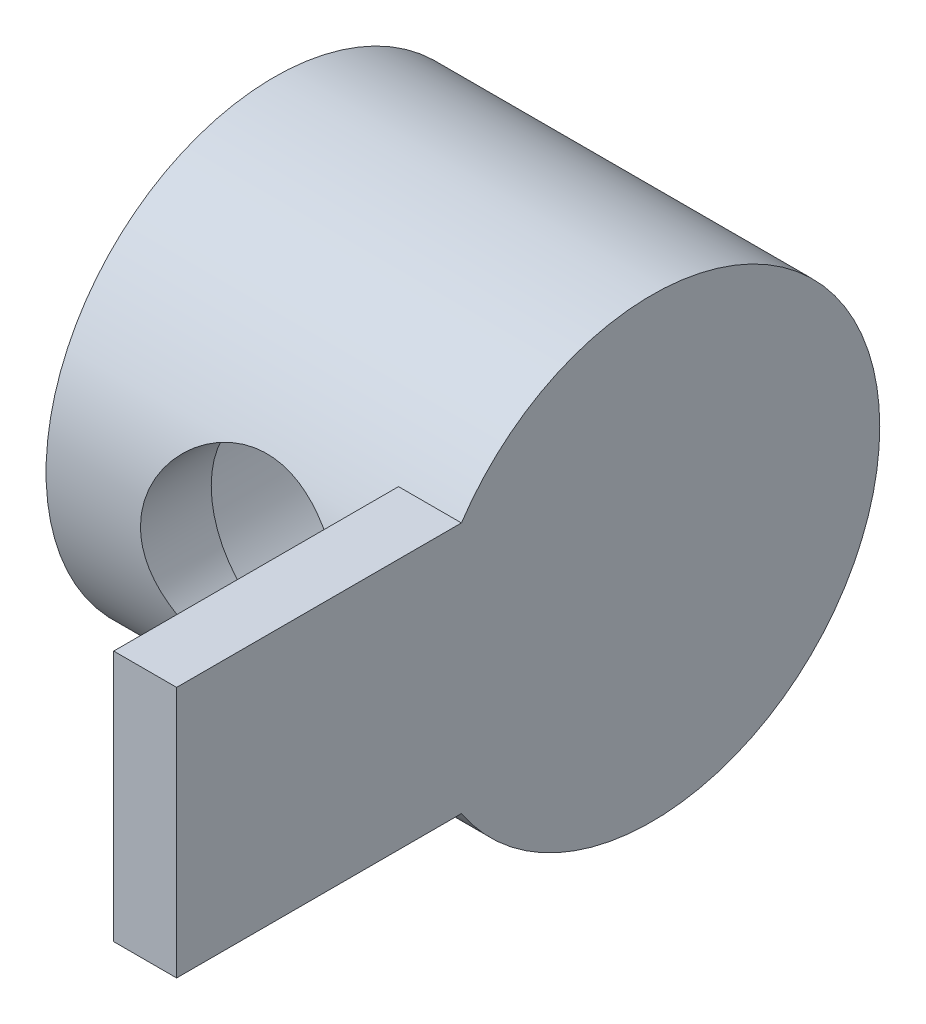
ISO-10303-21;
HEADER;
FILE_DESCRIPTION(('STEP AP214'),'2;1');
FILE_NAME('part.step','',(''),(''),'','','');
FILE_SCHEMA(('AUTOMOTIVE_DESIGN { 1 0 10303 214 1 1 1 1 }'));
ENDSEC;
DATA;
#1=APPLICATION_CONTEXT('core data for automotive mechanical design processes');
#2=APPLICATION_PROTOCOL_DEFINITION('international standard','automotive_design',2000,#1);
#3=PRODUCT_CONTEXT('',#1,'mechanical');
#4=PRODUCT('Part','Part','',(#3));
#5=PRODUCT_RELATED_PRODUCT_CATEGORY('part','',(#4));
#6=PRODUCT_DEFINITION_FORMATION('','',#4);
#7=PRODUCT_DEFINITION_CONTEXT('part definition',#1,'design');
#8=PRODUCT_DEFINITION('design','',#6,#7);
#9=PRODUCT_DEFINITION_SHAPE('','',#8);
#10=(LENGTH_UNIT() NAMED_UNIT(*) SI_UNIT(.MILLI.,.METRE.));
#11=(NAMED_UNIT(*) PLANE_ANGLE_UNIT() SI_UNIT($,.RADIAN.));
#12=(NAMED_UNIT(*) SI_UNIT($,.STERADIAN.) SOLID_ANGLE_UNIT());
#13=UNCERTAINTY_MEASURE_WITH_UNIT(LENGTH_MEASURE(1.E-05),#10,'distance_accuracy_value','');
#14=(GEOMETRIC_REPRESENTATION_CONTEXT(3) GLOBAL_UNCERTAINTY_ASSIGNED_CONTEXT((#13)) GLOBAL_UNIT_ASSIGNED_CONTEXT((#10,
#11,#12)) REPRESENTATION_CONTEXT('',''));
#15=CARTESIAN_POINT('',(0.,0.,0.));
#16=DIRECTION('',(0.,0.,1.));
#17=DIRECTION('',(1.,0.,0.));
#18=AXIS2_PLACEMENT_3D('',#15,#16,#17);
#19=CARTESIAN_POINT('',(3.483226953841,0.,5.));
#20=DIRECTION('',(0.,0.,-1.));
#21=DIRECTION('',(-1.,0.,0.));
#22=AXIS2_PLACEMENT_3D('',#19,#20,#21);
#23=PLANE('',#22);
#24=CARTESIAN_POINT('',(10.25,0.,5.));
#25=DIRECTION('',(0.,0.,1.));
#26=DIRECTION('',(1.,0.,0.));
#27=AXIS2_PLACEMENT_3D('',#24,#25,#26);
#28=CIRCLE('',#27,5.);
#29=CARTESIAN_POINT('',(15.25,0.,5.));
#30=VERTEX_POINT('',#29);
#31=EDGE_CURVE('E103',#30,#30,#28,.F.);
#32=ORIENTED_EDGE('',*,*,#31,.T.);
#33=EDGE_LOOP('',(#32));
#34=FACE_BOUND('',#33,.T.);
#35=CARTESIAN_POINT('',(10.25,0.,5.));
#36=DIRECTION('',(0.,0.,-1.));
#37=DIRECTION('',(-1.,0.,0.));
#38=AXIS2_PLACEMENT_3D('',#35,#36,#37);
#39=CIRCLE('',#38,3.25);
#40=CARTESIAN_POINT('',(7.,0.,5.));
#41=VERTEX_POINT('',#40);
#42=EDGE_CURVE('E19',#41,#41,#39,.F.);
#43=ORIENTED_EDGE('',*,*,#42,.T.);
#44=EDGE_LOOP('',(#43));
#45=FACE_BOUND('',#44,.T.);
#46=ADVANCED_FACE('F16',(#34,#45),#23,.T.);
#47=CARTESIAN_POINT('',(4.,9.88,0.));
#48=DIRECTION('',(1.,0.,0.));
#49=DIRECTION('',(0.,0.,-1.));
#50=AXIS2_PLACEMENT_3D('',#47,#48,#49);
#51=PLANE('',#50);
#52=CARTESIAN_POINT('',(4.,0.,0.));
#53=DIRECTION('',(1.,0.,0.));
#54=DIRECTION('',(0.,0.,-1.));
#55=AXIS2_PLACEMENT_3D('',#52,#53,#54);
#56=CIRCLE('',#55,7.25);
#57=CARTESIAN_POINT('',(4.,0.,-7.25));
#58=VERTEX_POINT('',#57);
#59=EDGE_CURVE('E95',#58,#58,#56,.T.);
#60=ORIENTED_EDGE('',*,*,#59,.F.);
#61=EDGE_LOOP('',(#60));
#62=FACE_BOUND('',#61,.T.);
#63=ADVANCED_FACE('F147',(#62),#51,.F.);
#64=CARTESIAN_POINT('',(10.25,0.,7.25));
#65=DIRECTION('',(0.,0.,-1.));
#66=DIRECTION('',(-1.,0.,0.));
#67=AXIS2_PLACEMENT_3D('',#64,#65,#66);
#68=CYLINDRICAL_SURFACE('',#67,3.25);
#69=CARTESIAN_POINT('',(7.,0.,7.25));
#70=CARTESIAN_POINT('',(7.00001207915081,0.1730771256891,7.24999031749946));
#71=CARTESIAN_POINT('',(7.01389619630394,0.346290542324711,7.24373775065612));
#72=CARTESIAN_POINT('',(7.06885485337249,0.687593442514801,7.21935611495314));
#73=CARTESIAN_POINT('',(7.10996312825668,0.855676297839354,7.20121231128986));
#74=CARTESIAN_POINT('',(7.21750337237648,1.18143697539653,7.15497693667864));
#75=CARTESIAN_POINT('',(7.28385529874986,1.33914585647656,7.12691682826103));
#76=CARTESIAN_POINT('',(7.43961090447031,1.64106509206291,7.06351455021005));
#77=CARTESIAN_POINT('',(7.52901591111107,1.78527466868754,7.02817196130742));
#78=CARTESIAN_POINT('',(7.73360767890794,2.06439590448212,6.95145927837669));
#79=CARTESIAN_POINT('',(7.8498827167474,2.19844967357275,6.90987284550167));
#80=CARTESIAN_POINT('',(8.10259558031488,2.44590672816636,6.82620933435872));
#81=CARTESIAN_POINT('',(8.23904434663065,2.55929873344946,6.78413200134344));
#82=CARTESIAN_POINT('',(8.53796140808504,2.76887368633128,6.70143888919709));
#83=CARTESIAN_POINT('',(8.70149000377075,2.86364619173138,6.6610558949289));
#84=CARTESIAN_POINT('',(9.04422170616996,3.02395910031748,6.58983478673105));
#85=CARTESIAN_POINT('',(9.22341558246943,3.08951658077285,6.55899109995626));
#86=CARTESIAN_POINT('',(9.58251657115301,3.18585105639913,6.51272514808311));
#87=CARTESIAN_POINT('',(9.76187860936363,3.21829278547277,6.49656977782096));
#88=CARTESIAN_POINT('',(10.1241711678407,3.25264726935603,6.47944404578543));
#89=CARTESIAN_POINT('',(10.3070991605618,3.25458091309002,6.47846329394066));
#90=CARTESIAN_POINT('',(10.6534406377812,3.22910403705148,6.49118752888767));
#91=CARTESIAN_POINT('',(10.8171097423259,3.20435907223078,6.50355860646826));
#92=CARTESIAN_POINT('',(11.1376652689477,3.13075179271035,6.53930803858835));
#93=CARTESIAN_POINT('',(11.2945501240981,3.08188393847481,6.56268892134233));
#94=CARTESIAN_POINT('',(11.6013281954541,2.96044850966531,6.61836639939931));
#95=CARTESIAN_POINT('',(11.7509833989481,2.88737047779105,6.65085247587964));
#96=CARTESIAN_POINT('',(12.0365408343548,2.71996261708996,6.72105148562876));
#97=CARTESIAN_POINT('',(12.1724376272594,2.62562443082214,6.75876647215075));
#98=CARTESIAN_POINT('',(12.4408179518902,2.40740567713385,6.8397158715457));
#99=CARTESIAN_POINT('',(12.5716264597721,2.28152316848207,6.88312672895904));
#100=CARTESIAN_POINT('',(12.8109131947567,2.00925841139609,6.96747591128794));
#101=CARTESIAN_POINT('',(12.9193790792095,1.86286490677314,7.0084128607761));
#102=CARTESIAN_POINT('',(13.1139663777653,1.54772362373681,7.08477352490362));
#103=CARTESIAN_POINT('',(13.1992882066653,1.37842232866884,7.11998624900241));
#104=CARTESIAN_POINT('',(13.3044569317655,1.11435995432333,7.16440691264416));
#105=CARTESIAN_POINT('',(13.3357040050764,1.02468668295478,7.17781089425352));
#106=CARTESIAN_POINT('',(13.390315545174,0.842578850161,7.20145610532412));
#107=CARTESIAN_POINT('',(13.4136832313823,0.750145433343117,7.21169862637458));
#108=CARTESIAN_POINT('',(13.4551715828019,0.549045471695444,7.22998767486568));
#109=CARTESIAN_POINT('',(13.4719547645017,0.440047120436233,7.23746374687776));
#110=CARTESIAN_POINT('',(13.4943726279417,0.220717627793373,7.24747290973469));
#111=CARTESIAN_POINT('',(13.5000077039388,0.11038653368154,7.25000617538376));
#112=CARTESIAN_POINT('',(13.4999879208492,-0.173077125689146,7.24999031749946));
#113=CARTESIAN_POINT('',(13.4861038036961,-0.346290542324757,7.24373775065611));
#114=CARTESIAN_POINT('',(13.4311451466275,-0.687593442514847,7.21935611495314));
#115=CARTESIAN_POINT('',(13.3900368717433,-0.855676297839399,7.20121231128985));
#116=CARTESIAN_POINT('',(13.2824966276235,-1.18143697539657,7.15497693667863));
#117=CARTESIAN_POINT('',(13.2161447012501,-1.3391458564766,7.12691682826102));
#118=CARTESIAN_POINT('',(13.0603890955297,-1.64106509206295,7.06351455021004));
#119=CARTESIAN_POINT('',(12.9709840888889,-1.78527466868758,7.02817196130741));
#120=CARTESIAN_POINT('',(12.766392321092,-2.06439590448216,6.95145927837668));
#121=CARTESIAN_POINT('',(12.6501172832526,-2.19844967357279,6.90987284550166));
#122=CARTESIAN_POINT('',(12.3974044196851,-2.4459067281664,6.82620933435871));
#123=CARTESIAN_POINT('',(12.2609556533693,-2.55929873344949,6.78413200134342));
#124=CARTESIAN_POINT('',(11.9620385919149,-2.76887368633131,6.70143888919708));
#125=CARTESIAN_POINT('',(11.7985099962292,-2.86364619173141,6.66105589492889));
#126=CARTESIAN_POINT('',(11.45577829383,-3.0239591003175,6.58983478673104));
#127=CARTESIAN_POINT('',(11.2765844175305,-3.08951658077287,6.55899109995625));
#128=CARTESIAN_POINT('',(10.9174834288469,-3.18585105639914,6.5127251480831));
#129=CARTESIAN_POINT('',(10.7381213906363,-3.21829278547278,6.49656977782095));
#130=CARTESIAN_POINT('',(10.3758288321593,-3.25264726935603,6.47944404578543));
#131=CARTESIAN_POINT('',(10.1929008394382,-3.25458091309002,6.47846329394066));
#132=CARTESIAN_POINT('',(9.84655936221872,-3.22910403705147,6.49118752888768));
#133=CARTESIAN_POINT('',(9.68289025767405,-3.20435907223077,6.50355860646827));
#134=CARTESIAN_POINT('',(9.36233473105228,-3.13075179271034,6.53930803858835));
#135=CARTESIAN_POINT('',(9.20544987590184,-3.08188393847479,6.56268892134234));
#136=CARTESIAN_POINT('',(8.89867180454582,-2.96044850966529,6.61836639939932));
#137=CARTESIAN_POINT('',(8.74901660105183,-2.88737047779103,6.65085247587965));
#138=CARTESIAN_POINT('',(8.46345916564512,-2.71996261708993,6.72105148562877));
#139=CARTESIAN_POINT('',(8.32756237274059,-2.6256244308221,6.75876647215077));
#140=CARTESIAN_POINT('',(8.05918204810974,-2.40740567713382,6.83971587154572));
#141=CARTESIAN_POINT('',(7.9283735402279,-2.28152316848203,6.88312672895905));
#142=CARTESIAN_POINT('',(7.68908680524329,-2.00925841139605,6.96747591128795));
#143=CARTESIAN_POINT('',(7.58062092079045,-1.86286490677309,7.00841286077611));
#144=CARTESIAN_POINT('',(7.3860336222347,-1.54772362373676,7.08477352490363));
#145=CARTESIAN_POINT('',(7.30071179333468,-1.37842232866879,7.11998624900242));
#146=CARTESIAN_POINT('',(7.19554306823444,-1.11435995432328,7.16440691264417));
#147=CARTESIAN_POINT('',(7.16429599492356,-1.02468668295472,7.17781089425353));
#148=CARTESIAN_POINT('',(7.10968445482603,-0.842578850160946,7.20145610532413));
#149=CARTESIAN_POINT('',(7.08631676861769,-0.750145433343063,7.21169862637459));
#150=CARTESIAN_POINT('',(7.04482841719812,-0.549045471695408,7.22998767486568));
#151=CARTESIAN_POINT('',(7.02804523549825,-0.440047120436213,7.23746374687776));
#152=CARTESIAN_POINT('',(7.00562737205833,-0.220717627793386,7.24747290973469));
#153=CARTESIAN_POINT('',(6.99999229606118,-0.110386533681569,7.25000617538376));
#154=CARTESIAN_POINT('',(7.,0.,7.25));
#155=B_SPLINE_CURVE_WITH_KNOTS('',3,(#69,#70,#71,#72,#73,#74,#75,#76,#77,#78,#79,#80,#81,#82,
#83,#84,#85,#86,#87,#88,#89,#90,#91,#92,#93,#94,#95,#96,#97,#98,#99,#100,#101,#102,#103,#104,
#105,#106,#107,#108,#109,#110,#111,#112,#113,#114,#115,#116,#117,#118,#119,#120,#121,#122,#123,
#124,#125,#126,#127,#128,#129,#130,#131,#132,#133,#134,#135,#136,#137,#138,#139,#140,#141,#142,
#143,#144,#145,#146,#147,#148,#149,#150,#151,#152,#153,#154),.UNSPECIFIED.,.T.,.F.,(4,2,2,2,2,2,
2,2,2,2,2,2,2,2,2,2,2,2,2,2,2,2,2,2,2,2,2,2,2,2,2,2,2,2,2,2,2,2,2,2,2,2,4),(0.,
0.518816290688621,1.03827668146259,1.55610350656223,2.07396015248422,2.61841275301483,
3.16316171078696,3.74005780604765,4.31661624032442,4.86250268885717,5.40801535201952,
5.90367470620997,6.39944793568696,6.9064211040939,7.4135939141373,7.97106352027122,
8.52884026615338,9.10395932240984,9.39132116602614,9.67856545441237,10.0094720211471,
10.340366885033,10.8591831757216,11.3786435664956,11.8964703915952,12.4143270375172,
12.9587796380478,13.5035285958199,14.0804246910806,14.6569831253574,15.2028695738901,
15.7483822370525,16.2440415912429,16.7398148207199,17.2467879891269,17.7539607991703,
18.3114304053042,18.8692071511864,19.4443262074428,19.7316880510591,20.0189323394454,
20.34983890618,20.6807337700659),.UNSPECIFIED.);
#156=CARTESIAN_POINT('',(7.,0.,7.25));
#157=VERTEX_POINT('',#156);
#158=EDGE_CURVE('E137',#157,#157,#155,.T.);
#159=ORIENTED_EDGE('',*,*,#158,.F.);
#160=EDGE_LOOP('',(#159));
#161=FACE_BOUND('',#160,.T.);
#162=ORIENTED_EDGE('',*,*,#42,.F.);
#163=EDGE_LOOP('',(#162));
#164=FACE_BOUND('',#163,.T.);
#165=ADVANCED_FACE('F144',(#161,#164),#68,.F.);
#166=CARTESIAN_POINT('',(10.25,0.,-2.25));
#167=DIRECTION('',(0.,0.,1.));
#168=DIRECTION('',(1.,0.,0.));
#169=AXIS2_PLACEMENT_3D('',#166,#167,#168);
#170=CYLINDRICAL_SURFACE('',#169,5.);
#171=CARTESIAN_POINT('',(15.25,0.,-7.25));
#172=CARTESIAN_POINT('',(15.2499995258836,0.124583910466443,-7.24999954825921));
#173=CARTESIAN_POINT('',(15.2453368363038,0.249175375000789,-7.24678163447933));
#174=CARTESIAN_POINT('',(15.2267565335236,0.497385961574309,-7.23398651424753));
#175=CARTESIAN_POINT('',(15.2128347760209,0.62100462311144,-7.22440646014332));
#176=CARTESIAN_POINT('',(15.1759249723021,0.866419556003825,-7.19910106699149));
#177=CARTESIAN_POINT('',(15.1529240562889,0.988212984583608,-7.18336700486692));
#178=CARTESIAN_POINT('',(15.0981850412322,1.22896345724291,-7.14611758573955));
#179=CARTESIAN_POINT('',(15.0664431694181,1.34791925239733,-7.12459973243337));
#180=CARTESIAN_POINT('',(14.9948626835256,1.58148869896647,-7.07640620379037));
#181=CARTESIAN_POINT('',(14.955073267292,1.69612393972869,-7.04976191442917));
#182=CARTESIAN_POINT('',(14.8677471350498,1.92119824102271,-6.99178288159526));
#183=CARTESIAN_POINT('',(14.8202073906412,2.03163564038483,-6.96044630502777));
#184=CARTESIAN_POINT('',(14.6667444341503,2.3557188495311,-6.86032646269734));
#185=CARTESIAN_POINT('',(14.5498930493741,2.56240668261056,-6.78537502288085));
#186=CARTESIAN_POINT('',(14.2795179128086,2.97125007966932,-6.61719953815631));
#187=CARTESIAN_POINT('',(14.1236808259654,3.17142875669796,-6.52295075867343));
#188=CARTESIAN_POINT('',(13.7853151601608,3.54472926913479,-6.32785549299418));
#189=CARTESIAN_POINT('',(13.6027458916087,3.71780901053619,-6.22699908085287));
#190=CARTESIAN_POINT('',(13.2942641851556,3.96913479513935,-6.06799533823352));
#191=CARTESIAN_POINT('',(13.1762244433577,4.0569578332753,-6.00946880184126));
#192=CARTESIAN_POINT('',(12.9321753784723,4.22228436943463,-5.8944863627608));
#193=CARTESIAN_POINT('',(12.8061640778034,4.29978529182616,-5.83803097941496));
#194=CARTESIAN_POINT('',(12.4168970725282,4.51579754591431,-5.6747195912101));
#195=CARTESIAN_POINT('',(12.1417891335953,4.63832612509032,-5.57358080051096));
#196=CARTESIAN_POINT('',(11.6526594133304,4.80388318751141,-5.43078512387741));
#197=CARTESIAN_POINT('',(11.4455567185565,4.85975910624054,-5.38039384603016));
#198=CARTESIAN_POINT('',(11.1279255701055,4.92350727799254,-5.32187691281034));
#199=CARTESIAN_POINT('',(11.02092786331,4.9414093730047,-5.30521937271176));
#200=CARTESIAN_POINT('',(10.805231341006,4.97026565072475,-5.27819681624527));
#201=CARTESIAN_POINT('',(10.6965331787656,4.98122243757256,-5.26782944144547));
#202=CARTESIAN_POINT('',(10.4776213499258,4.99602748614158,-5.25379039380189));
#203=CARTESIAN_POINT('',(10.3674026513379,4.99983665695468,-5.2501555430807));
#204=CARTESIAN_POINT('',(10.1469457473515,5.00015304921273,-5.24985426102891));
#205=CARTESIAN_POINT('',(10.0367075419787,4.99666028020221,-5.25318782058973));
#206=CARTESIAN_POINT('',(9.81707521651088,4.98243803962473,-5.26667894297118));
#207=CARTESIAN_POINT('',(9.7076814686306,4.97170554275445,-5.2768393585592));
#208=CARTESIAN_POINT('',(9.49058582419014,4.94320706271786,-5.30354381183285));
#209=CARTESIAN_POINT('',(9.38288465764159,4.92543812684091,-5.32009052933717));
#210=CARTESIAN_POINT('',(9.07605442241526,4.86451338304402,-5.37605483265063));
#211=CARTESIAN_POINT('',(8.8798932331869,4.81277863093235,-5.42278368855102));
#212=CARTESIAN_POINT('',(8.49904383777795,4.68769327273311,-5.53125819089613));
#213=CARTESIAN_POINT('',(8.31436478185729,4.61432568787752,-5.59301562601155));
#214=CARTESIAN_POINT('',(8.00157570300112,4.46840358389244,-5.70984685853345));
#215=CARTESIAN_POINT('',(7.87068870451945,4.400050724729,-5.76285318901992));
#216=CARTESIAN_POINT('',(7.61652199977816,4.25280680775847,-5.87235443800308));
#217=CARTESIAN_POINT('',(7.49324255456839,4.17391538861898,-5.92884947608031));
#218=CARTESIAN_POINT('',(7.25435235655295,4.00592787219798,-6.04362580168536));
#219=CARTESIAN_POINT('',(7.13875634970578,3.91681299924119,-6.10191022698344));
#220=CARTESIAN_POINT('',(6.91581438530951,3.7288682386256,-6.21854262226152));
#221=CARTESIAN_POINT('',(6.80846740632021,3.63003955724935,-6.27689058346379));
#222=CARTESIAN_POINT('',(6.60139387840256,3.42190593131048,-6.39276080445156));
#223=CARTESIAN_POINT('',(6.50175593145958,3.31250466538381,-6.45026863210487));
#224=CARTESIAN_POINT('',(6.31193304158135,3.08441825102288,-6.56239355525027));
#225=CARTESIAN_POINT('',(6.22174696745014,2.965734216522,-6.61701099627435));
#226=CARTESIAN_POINT('',(6.05168132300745,2.71964333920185,-6.7218975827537));
#227=CARTESIAN_POINT('',(5.97178803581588,2.59224845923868,-6.7721724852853));
#228=CARTESIAN_POINT('',(5.82306957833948,2.32918385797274,-6.86709083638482));
#229=CARTESIAN_POINT('',(5.75424076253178,2.19351688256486,-6.9117361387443));
#230=CARTESIAN_POINT('',(5.64251449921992,1.94557432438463,-6.98498837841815));
#231=CARTESIAN_POINT('',(5.59724879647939,1.83476273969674,-7.01495852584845));
#232=CARTESIAN_POINT('',(5.51448312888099,1.6091336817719,-7.07012498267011));
#233=CARTESIAN_POINT('',(5.47698146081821,1.4943170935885,-7.09532233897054));
#234=CARTESIAN_POINT('',(5.41025072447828,1.26153032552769,-7.14038294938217));
#235=CARTESIAN_POINT('',(5.38100545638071,1.14356682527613,-7.16025664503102));
#236=CARTESIAN_POINT('',(5.33108938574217,0.905069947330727,-7.19429271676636));
#237=CARTESIAN_POINT('',(5.31041504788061,0.784537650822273,-7.20845744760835));
#238=CARTESIAN_POINT('',(5.27950988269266,0.553578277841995,-7.22967215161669));
#239=CARTESIAN_POINT('',(5.26845730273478,0.44331184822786,-7.23728119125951));
#240=CARTESIAN_POINT('',(5.25370139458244,0.222032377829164,-7.24744583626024));
#241=CARTESIAN_POINT('',(5.24999957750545,0.1110191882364,-7.25000040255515));
#242=CARTESIAN_POINT('',(5.25000047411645,-0.124583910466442,-7.24999954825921));
#243=CARTESIAN_POINT('',(5.25466316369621,-0.249175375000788,-7.24678163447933));
#244=CARTESIAN_POINT('',(5.27324346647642,-0.497385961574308,-7.23398651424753));
#245=CARTESIAN_POINT('',(5.28716522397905,-0.62100462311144,-7.22440646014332));
#246=CARTESIAN_POINT('',(5.32407502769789,-0.866419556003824,-7.19910106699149));
#247=CARTESIAN_POINT('',(5.34707594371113,-0.988212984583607,-7.18336700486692));
#248=CARTESIAN_POINT('',(5.40181495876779,-1.22896345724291,-7.14611758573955));
#249=CARTESIAN_POINT('',(5.4335568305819,-1.34791925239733,-7.12459973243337));
#250=CARTESIAN_POINT('',(5.50513731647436,-1.58148869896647,-7.07640620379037));
#251=CARTESIAN_POINT('',(5.54492673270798,-1.69612393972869,-7.04976191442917));
#252=CARTESIAN_POINT('',(5.63225286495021,-1.9211982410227,-6.99178288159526));
#253=CARTESIAN_POINT('',(5.6797926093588,-2.03163564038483,-6.96044630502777));
#254=CARTESIAN_POINT('',(5.83325556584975,-2.3557188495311,-6.86032646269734));
#255=CARTESIAN_POINT('',(5.95010695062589,-2.56240668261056,-6.78537502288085));
#256=CARTESIAN_POINT('',(6.22048208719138,-2.97125007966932,-6.61719953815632));
#257=CARTESIAN_POINT('',(6.37631917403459,-3.17142875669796,-6.52295075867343));
#258=CARTESIAN_POINT('',(6.71468483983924,-3.54472926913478,-6.32785549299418));
#259=CARTESIAN_POINT('',(6.89725410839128,-3.71780901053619,-6.22699908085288));
#260=CARTESIAN_POINT('',(7.20573581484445,-3.96913479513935,-6.06799533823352));
#261=CARTESIAN_POINT('',(7.32377555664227,-4.0569578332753,-6.00946880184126));
#262=CARTESIAN_POINT('',(7.56782462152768,-4.22228436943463,-5.8944863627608));
#263=CARTESIAN_POINT('',(7.69383592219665,-4.29978529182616,-5.83803097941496));
#264=CARTESIAN_POINT('',(8.08310292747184,-4.51579754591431,-5.6747195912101));
#265=CARTESIAN_POINT('',(8.35821086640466,-4.63832612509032,-5.57358080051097));
#266=CARTESIAN_POINT('',(8.84734058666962,-4.80388318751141,-5.43078512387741));
#267=CARTESIAN_POINT('',(9.0544432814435,-4.85975910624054,-5.38039384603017));
#268=CARTESIAN_POINT('',(9.37207442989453,-4.92350727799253,-5.32187691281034));
#269=CARTESIAN_POINT('',(9.47907213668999,-4.9414093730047,-5.30521937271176));
#270=CARTESIAN_POINT('',(9.69476865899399,-4.97026565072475,-5.27819681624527));
#271=CARTESIAN_POINT('',(9.80346682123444,-4.98122243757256,-5.26782944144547));
#272=CARTESIAN_POINT('',(10.0223786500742,-4.99602748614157,-5.25379039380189));
#273=CARTESIAN_POINT('',(10.1325973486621,-4.99983665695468,-5.2501555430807));
#274=CARTESIAN_POINT('',(10.3530542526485,-5.00015304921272,-5.24985426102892));
#275=CARTESIAN_POINT('',(10.4632924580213,-4.99666028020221,-5.25318782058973));
#276=CARTESIAN_POINT('',(10.6829247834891,-4.98243803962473,-5.26667894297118));
#277=CARTESIAN_POINT('',(10.7923185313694,-4.97170554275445,-5.27683935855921));
#278=CARTESIAN_POINT('',(11.0094141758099,-4.94320706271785,-5.30354381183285));
#279=CARTESIAN_POINT('',(11.1171153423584,-4.92543812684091,-5.32009052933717));
#280=CARTESIAN_POINT('',(11.4239455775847,-4.86451338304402,-5.37605483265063));
#281=CARTESIAN_POINT('',(11.6201067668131,-4.81277863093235,-5.42278368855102));
#282=CARTESIAN_POINT('',(12.000956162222,-4.68769327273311,-5.53125819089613));
#283=CARTESIAN_POINT('',(12.1856352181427,-4.61432568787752,-5.59301562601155));
#284=CARTESIAN_POINT('',(12.4984242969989,-4.46840358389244,-5.70984685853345));
#285=CARTESIAN_POINT('',(12.6293112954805,-4.400050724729,-5.76285318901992));
#286=CARTESIAN_POINT('',(12.8834780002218,-4.25280680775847,-5.87235443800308));
#287=CARTESIAN_POINT('',(13.0067574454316,-4.17391538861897,-5.92884947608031));
#288=CARTESIAN_POINT('',(13.245647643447,-4.00592787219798,-6.04362580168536));
#289=CARTESIAN_POINT('',(13.3612436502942,-3.91681299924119,-6.10191022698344));
#290=CARTESIAN_POINT('',(13.5841856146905,-3.7288682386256,-6.21854262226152));
#291=CARTESIAN_POINT('',(13.6915325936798,-3.63003955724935,-6.27689058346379));
#292=CARTESIAN_POINT('',(13.8986061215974,-3.42190593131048,-6.39276080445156));
#293=CARTESIAN_POINT('',(13.9982440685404,-3.31250466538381,-6.45026863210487));
#294=CARTESIAN_POINT('',(14.1880669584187,-3.08441825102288,-6.56239355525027));
#295=CARTESIAN_POINT('',(14.2782530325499,-2.96573421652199,-6.61701099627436));
#296=CARTESIAN_POINT('',(14.4483186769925,-2.71964333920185,-6.72189758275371));
#297=CARTESIAN_POINT('',(14.5282119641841,-2.59224845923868,-6.7721724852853));
#298=CARTESIAN_POINT('',(14.6769304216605,-2.32918385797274,-6.86709083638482));
#299=CARTESIAN_POINT('',(14.7457592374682,-2.19351688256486,-6.9117361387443));
#300=CARTESIAN_POINT('',(14.8574855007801,-1.94557432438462,-6.98498837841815));
#301=CARTESIAN_POINT('',(14.9027512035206,-1.83476273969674,-7.01495852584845));
#302=CARTESIAN_POINT('',(14.985516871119,-1.6091336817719,-7.07012498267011));
#303=CARTESIAN_POINT('',(15.0230185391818,-1.49431709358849,-7.09532233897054));
#304=CARTESIAN_POINT('',(15.0897492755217,-1.26153032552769,-7.14038294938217));
#305=CARTESIAN_POINT('',(15.1189945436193,-1.14356682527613,-7.16025664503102));
#306=CARTESIAN_POINT('',(15.1689106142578,-0.905069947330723,-7.19429271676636));
#307=CARTESIAN_POINT('',(15.1895849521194,-0.784537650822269,-7.20845744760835));
#308=CARTESIAN_POINT('',(15.2204901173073,-0.553578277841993,-7.22967215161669));
#309=CARTESIAN_POINT('',(15.2315426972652,-0.443311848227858,-7.23728119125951));
#310=CARTESIAN_POINT('',(15.2462986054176,-0.222032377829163,-7.24744583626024));
#311=CARTESIAN_POINT('',(15.2500004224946,-0.111019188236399,-7.25000040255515));
#312=CARTESIAN_POINT('',(15.25,0.,-7.25));
#313=B_SPLINE_CURVE_WITH_KNOTS('',3,(#171,#172,#173,#174,#175,#176,#177,#178,#179,#180,#181,
#182,#183,#184,#185,#186,#187,#188,#189,#190,#191,#192,#193,#194,#195,#196,#197,#198,#199,#200,
#201,#202,#203,#204,#205,#206,#207,#208,#209,#210,#211,#212,#213,#214,#215,#216,#217,#218,#219,
#220,#221,#222,#223,#224,#225,#226,#227,#228,#229,#230,#231,#232,#233,#234,#235,#236,#237,#238,
#239,#240,#241,#242,#243,#244,#245,#246,#247,#248,#249,#250,#251,#252,#253,#254,#255,#256,#257,
#258,#259,#260,#261,#262,#263,#264,#265,#266,#267,#268,#269,#270,#271,#272,#273,#274,#275,#276,
#277,#278,#279,#280,#281,#282,#283,#284,#285,#286,#287,#288,#289,#290,#291,#292,#293,#294,#295,
#296,#297,#298,#299,#300,#301,#302,#303,#304,#305,#306,#307,#308,#309,#310,#311,#312),
.UNSPECIFIED.,.T.,.F.,(4,2,2,2,2,2,2,2,2,2,2,2,2,2,2,2,2,2,2,2,2,2,2,2,2,2,2,2,2,2,2,2,2,2,2,2,
2,2,2,2,2,2,2,2,2,2,2,2,2,2,2,2,2,2,2,2,2,2,2,2,2,2,2,2,2,2,2,2,2,2,4),(0.,0.373637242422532,
0.747441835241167,1.12177821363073,1.49627641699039,1.86855084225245,2.24097108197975,
2.98495193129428,3.79399197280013,4.6042765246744,5.07878644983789,5.55341455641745,
6.50009520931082,7.15840718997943,7.48731205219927,7.81609351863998,8.14666793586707,
8.47724192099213,8.80795413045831,9.13880526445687,9.76087500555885,10.383434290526,
10.853520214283,11.3236222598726,11.7946019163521,12.2655231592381,12.7412336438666,
13.2168871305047,13.6919000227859,14.1667560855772,14.536573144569,14.9063089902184,
15.2753142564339,15.6441671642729,15.9770542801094,16.3100098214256,16.6836470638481,
17.0574516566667,17.4317880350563,17.806286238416,18.178560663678,18.5509809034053,
19.2949617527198,20.1040017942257,20.9142863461,21.3887962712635,21.863424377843,
22.8101050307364,23.468417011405,23.7973218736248,24.1261033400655,24.4566777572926,
24.7872517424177,25.1179639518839,25.4488150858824,26.0708848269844,26.6934441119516,
27.1635300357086,27.6336320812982,28.1046117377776,28.5755329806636,29.0512434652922,
29.5268969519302,30.0019098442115,30.4767659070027,30.8465829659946,31.216318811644,
31.5853240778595,31.9541769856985,32.287064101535,32.6200196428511),.UNSPECIFIED.);
#314=CARTESIAN_POINT('',(15.25,0.,-7.25));
#315=VERTEX_POINT('',#314);
#316=EDGE_CURVE('E112',#315,#315,#313,.T.);
#317=ORIENTED_EDGE('',*,*,#316,.F.);
#318=EDGE_LOOP('',(#317));
#319=FACE_BOUND('',#318,.T.);
#320=ORIENTED_EDGE('',*,*,#31,.F.);
#321=EDGE_LOOP('',(#320));
#322=FACE_BOUND('',#321,.T.);
#323=ADVANCED_FACE('F123',(#319,#322),#170,.F.);
#324=CARTESIAN_POINT('',(14.,0.,8.399180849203));
#325=DIRECTION('',(-1.,0.,0.));
#326=DIRECTION('',(0.,0.,1.));
#327=AXIS2_PLACEMENT_3D('',#324,#325,#326);
#328=PLANE('',#327);
#329=CARTESIAN_POINT('',(14.,0.,0.));
#330=DIRECTION('',(1.,0.,0.));
#331=DIRECTION('',(0.,0.,-1.));
#332=AXIS2_PLACEMENT_3D('',#329,#330,#331);
#333=CIRCLE('',#332,7.25);
#334=CARTESIAN_POINT('',(14.,-4.,6.04669331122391));
#335=VERTEX_POINT('',#334);
#336=CARTESIAN_POINT('',(14.,4.,6.04669331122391));
#337=VERTEX_POINT('',#336);
#338=EDGE_CURVE('E47',#335,#337,#333,.F.);
#339=ORIENTED_EDGE('',*,*,#338,.F.);
#340=DIRECTION('',(0.,0.,-1.));
#341=VECTOR('',#340,1.);
#342=CARTESIAN_POINT('',(14.,-4.,8.399180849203));
#343=LINE('',#342,#341);
#344=CARTESIAN_POINT('',(14.,-4.,15.1));
#345=VERTEX_POINT('',#344);
#346=EDGE_CURVE('E71',#345,#335,#343,.T.);
#347=ORIENTED_EDGE('',*,*,#346,.F.);
#348=DIRECTION('',(0.,1.,0.));
#349=VECTOR('',#348,1.);
#350=CARTESIAN_POINT('',(14.,0.,15.1));
#351=LINE('',#350,#349);
#352=CARTESIAN_POINT('',(14.,4.,15.1));
#353=VERTEX_POINT('',#352);
#354=EDGE_CURVE('E55',#353,#345,#351,.F.);
#355=ORIENTED_EDGE('',*,*,#354,.F.);
#356=DIRECTION('',(0.,0.,1.));
#357=VECTOR('',#356,1.);
#358=CARTESIAN_POINT('',(14.,4.,8.399180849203));
#359=LINE('',#358,#357);
#360=EDGE_CURVE('E81',#337,#353,#359,.T.);
#361=ORIENTED_EDGE('',*,*,#360,.F.);
#362=EDGE_LOOP('',(#339,#347,#355,#361));
#363=FACE_BOUND('',#362,.T.);
#364=ADVANCED_FACE('F188',(#363),#328,.T.);
#365=CARTESIAN_POINT('',(12.43,0.,15.1));
#366=DIRECTION('',(0.,0.,1.));
#367=DIRECTION('',(1.,0.,0.));
#368=AXIS2_PLACEMENT_3D('',#365,#366,#367);
#369=PLANE('',#368);
#370=DIRECTION('',(1.,0.,0.));
#371=VECTOR('',#370,1.);
#372=CARTESIAN_POINT('',(14.25,4.,15.1));
#373=LINE('',#372,#371);
#374=CARTESIAN_POINT('',(16.,4.,15.1));
#375=VERTEX_POINT('',#374);
#376=EDGE_CURVE('E121',#353,#375,#373,.T.);
#377=ORIENTED_EDGE('',*,*,#376,.F.);
#378=ORIENTED_EDGE('',*,*,#354,.T.);
#379=DIRECTION('',(1.,0.,0.));
#380=VECTOR('',#379,1.);
#381=CARTESIAN_POINT('',(14.25,-4.,15.1));
#382=LINE('',#381,#380);
#383=CARTESIAN_POINT('',(16.,-4.,15.1));
#384=VERTEX_POINT('',#383);
#385=EDGE_CURVE('E63',#384,#345,#382,.F.);
#386=ORIENTED_EDGE('',*,*,#385,.F.);
#387=DIRECTION('',(0.,1.,0.));
#388=VECTOR('',#387,1.);
#389=CARTESIAN_POINT('',(16.,9.880017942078,15.1));
#390=LINE('',#389,#388);
#391=EDGE_CURVE('E67',#375,#384,#390,.F.);
#392=ORIENTED_EDGE('',*,*,#391,.F.);
#393=EDGE_LOOP('',(#377,#378,#386,#392));
#394=FACE_BOUND('',#393,.T.);
#395=ADVANCED_FACE('F65',(#394),#369,.T.);
#396=CARTESIAN_POINT('',(14.25,-4.,8.399180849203));
#397=DIRECTION('',(0.,-1.,0.));
#398=DIRECTION('',(0.,0.,-1.));
#399=AXIS2_PLACEMENT_3D('',#396,#397,#398);
#400=PLANE('',#399);
#401=DIRECTION('',(1.,0.,0.));
#402=VECTOR('',#401,1.);
#403=CARTESIAN_POINT('',(8.,-4.,6.04669331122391));
#404=LINE('',#403,#402);
#405=CARTESIAN_POINT('',(16.,-4.,6.04669331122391));
#406=VERTEX_POINT('',#405);
#407=EDGE_CURVE('E75',#406,#335,#404,.F.);
#408=ORIENTED_EDGE('',*,*,#407,.F.);
#409=DIRECTION('',(0.,0.,-1.));
#410=VECTOR('',#409,1.);
#411=CARTESIAN_POINT('',(16.,-4.,5.));
#412=LINE('',#411,#410);
#413=EDGE_CURVE('E73',#384,#406,#412,.T.);
#414=ORIENTED_EDGE('',*,*,#413,.F.);
#415=ORIENTED_EDGE('',*,*,#385,.T.);
#416=ORIENTED_EDGE('',*,*,#346,.T.);
#417=EDGE_LOOP('',(#408,#414,#415,#416));
#418=FACE_BOUND('',#417,.T.);
#419=ADVANCED_FACE('F74',(#418),#400,.T.);
#420=CARTESIAN_POINT('',(8.,0.,0.));
#421=DIRECTION('',(1.,0.,0.));
#422=DIRECTION('',(0.,0.,-1.));
#423=AXIS2_PLACEMENT_3D('',#420,#421,#422);
#424=CYLINDRICAL_SURFACE('',#423,7.25);
#425=ORIENTED_EDGE('',*,*,#158,.T.);
#426=EDGE_LOOP('',(#425));
#427=FACE_BOUND('',#426,.T.);
#428=ORIENTED_EDGE('',*,*,#407,.T.);
#429=ORIENTED_EDGE('',*,*,#338,.T.);
#430=DIRECTION('',(1.,0.,0.));
#431=VECTOR('',#430,1.);
#432=CARTESIAN_POINT('',(14.25,4.,6.04669331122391));
#433=LINE('',#432,#431);
#434=CARTESIAN_POINT('',(16.,4.,6.04669331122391));
#435=VERTEX_POINT('',#434);
#436=EDGE_CURVE('E86',#435,#337,#433,.F.);
#437=ORIENTED_EDGE('',*,*,#436,.F.);
#438=CARTESIAN_POINT('',(16.,0.,0.));
#439=DIRECTION('',(1.,0.,0.));
#440=DIRECTION('',(0.,0.,-1.));
#441=AXIS2_PLACEMENT_3D('',#438,#439,#440);
#442=CIRCLE('',#441,7.25);
#443=EDGE_CURVE('E26',#406,#435,#442,.T.);
#444=ORIENTED_EDGE('',*,*,#443,.F.);
#445=EDGE_LOOP('',(#428,#429,#437,#444));
#446=FACE_BOUND('',#445,.T.);
#447=ORIENTED_EDGE('',*,*,#316,.T.);
#448=EDGE_LOOP('',(#447));
#449=FACE_BOUND('',#448,.T.);
#450=ORIENTED_EDGE('',*,*,#59,.T.);
#451=EDGE_LOOP('',(#450));
#452=FACE_BOUND('',#451,.T.);
#453=ADVANCED_FACE('F127',(#427,#446,#449,#452),#424,.T.);
#454=CARTESIAN_POINT('',(14.25,4.,8.399180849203));
#455=DIRECTION('',(0.,1.,0.));
#456=DIRECTION('',(0.,0.,1.));
#457=AXIS2_PLACEMENT_3D('',#454,#455,#456);
#458=PLANE('',#457);
#459=ORIENTED_EDGE('',*,*,#436,.T.);
#460=ORIENTED_EDGE('',*,*,#360,.T.);
#461=ORIENTED_EDGE('',*,*,#376,.T.);
#462=DIRECTION('',(0.,0.,-1.));
#463=VECTOR('',#462,1.);
#464=CARTESIAN_POINT('',(16.,4.,5.));
#465=LINE('',#464,#463);
#466=EDGE_CURVE('E10',#435,#375,#465,.F.);
#467=ORIENTED_EDGE('',*,*,#466,.F.);
#468=EDGE_LOOP('',(#459,#460,#461,#467));
#469=FACE_BOUND('',#468,.T.);
#470=ADVANCED_FACE('F132',(#469),#458,.T.);
#471=CARTESIAN_POINT('',(16.,9.880017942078,5.));
#472=DIRECTION('',(1.,0.,0.));
#473=DIRECTION('',(0.,0.,-1.));
#474=AXIS2_PLACEMENT_3D('',#471,#472,#473);
#475=PLANE('',#474);
#476=ORIENTED_EDGE('',*,*,#443,.T.);
#477=ORIENTED_EDGE('',*,*,#466,.T.);
#478=ORIENTED_EDGE('',*,*,#391,.T.);
#479=ORIENTED_EDGE('',*,*,#413,.T.);
#480=EDGE_LOOP('',(#476,#477,#478,#479));
#481=FACE_BOUND('',#480,.T.);
#482=ADVANCED_FACE('F78',(#481),#475,.T.);
#483=CLOSED_SHELL('',(#46,#63,#165,#323,#364,#395,#419,#453,#470,#482));
#484=MANIFOLD_SOLID_BREP('B1',#483);
#485=ADVANCED_BREP_SHAPE_REPRESENTATION('',(#18,#484),#14);
#486=SHAPE_DEFINITION_REPRESENTATION(#9,#485);
ENDSEC;
END-ISO-10303-21;
